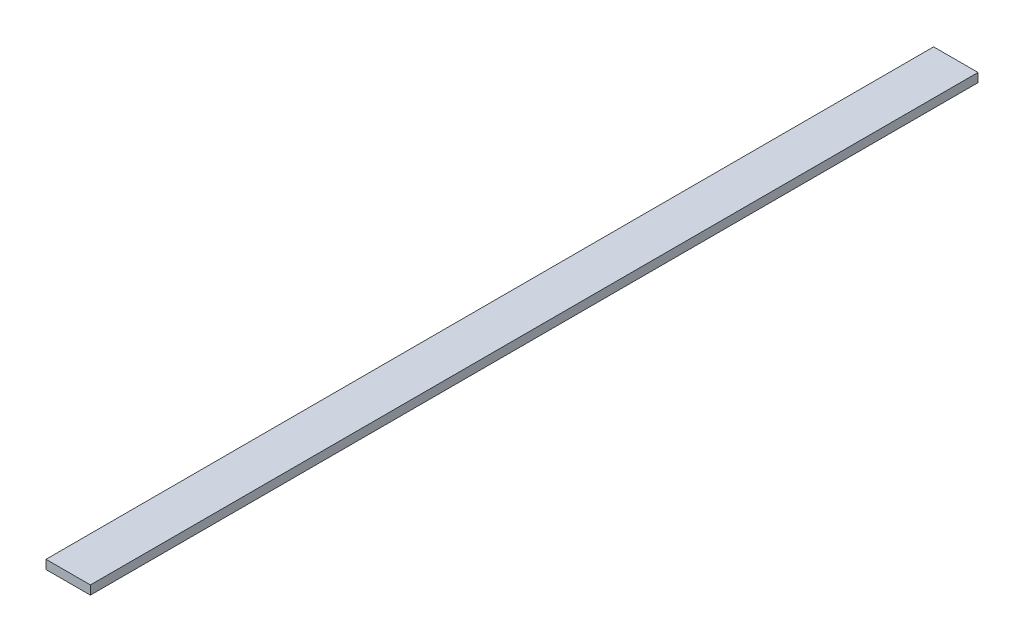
ISO-10303-21;
HEADER;
FILE_DESCRIPTION(('STEP AP214'),'2;1');
FILE_NAME('part.step','',(''),(''),'','','');
FILE_SCHEMA(('AUTOMOTIVE_DESIGN { 1 0 10303 214 1 1 1 1 }'));
ENDSEC;
DATA;
#1=APPLICATION_CONTEXT('core data for automotive mechanical design processes');
#2=APPLICATION_PROTOCOL_DEFINITION('international standard','automotive_design',2000,#1);
#3=PRODUCT_CONTEXT('',#1,'mechanical');
#4=PRODUCT('Part','Part','',(#3));
#5=PRODUCT_RELATED_PRODUCT_CATEGORY('part','',(#4));
#6=PRODUCT_DEFINITION_FORMATION('','',#4);
#7=PRODUCT_DEFINITION_CONTEXT('part definition',#1,'design');
#8=PRODUCT_DEFINITION('design','',#6,#7);
#9=PRODUCT_DEFINITION_SHAPE('','',#8);
#10=(LENGTH_UNIT() NAMED_UNIT(*) SI_UNIT(.MILLI.,.METRE.));
#11=(NAMED_UNIT(*) PLANE_ANGLE_UNIT() SI_UNIT($,.RADIAN.));
#12=(NAMED_UNIT(*) SI_UNIT($,.STERADIAN.) SOLID_ANGLE_UNIT());
#13=UNCERTAINTY_MEASURE_WITH_UNIT(LENGTH_MEASURE(1.E-05),#10,'distance_accuracy_value','');
#14=(GEOMETRIC_REPRESENTATION_CONTEXT(3) GLOBAL_UNCERTAINTY_ASSIGNED_CONTEXT((#13)) GLOBAL_UNIT_ASSIGNED_CONTEXT((#10,
#11,#12)) REPRESENTATION_CONTEXT('',''));
#15=CARTESIAN_POINT('',(0.,0.,0.));
#16=DIRECTION('',(0.,0.,1.));
#17=DIRECTION('',(1.,0.,0.));
#18=AXIS2_PLACEMENT_3D('',#15,#16,#17);
#19=CARTESIAN_POINT('',(12.5,0.,0.));
#20=DIRECTION('',(-1.,0.,0.));
#21=DIRECTION('',(0.,0.,1.));
#22=AXIS2_PLACEMENT_3D('',#19,#20,#21);
#23=PLANE('',#22);
#24=DIRECTION('',(0.,-1.,0.));
#25=VECTOR('',#24,1.);
#26=CARTESIAN_POINT('',(12.5,2.5,0.));
#27=LINE('',#26,#25);
#28=CARTESIAN_POINT('',(12.5,5.,0.));
#29=VERTEX_POINT('',#28);
#30=CARTESIAN_POINT('',(12.5,0.,0.));
#31=VERTEX_POINT('',#30);
#32=EDGE_CURVE('E51',#29,#31,#27,.T.);
#33=ORIENTED_EDGE('',*,*,#32,.F.);
#34=DIRECTION('',(0.,0.,-1.));
#35=VECTOR('',#34,1.);
#36=CARTESIAN_POINT('',(12.5,5.,250.));
#37=LINE('',#36,#35);
#38=CARTESIAN_POINT('',(12.5,5.,500.));
#39=VERTEX_POINT('',#38);
#40=EDGE_CURVE('E66',#39,#29,#37,.T.);
#41=ORIENTED_EDGE('',*,*,#40,.F.);
#42=DIRECTION('',(0.,-1.,0.));
#43=VECTOR('',#42,1.);
#44=CARTESIAN_POINT('',(12.5,2.5,500.));
#45=LINE('',#44,#43);
#46=CARTESIAN_POINT('',(12.5,0.,500.));
#47=VERTEX_POINT('',#46);
#48=EDGE_CURVE('E18',#39,#47,#45,.T.);
#49=ORIENTED_EDGE('',*,*,#48,.T.);
#50=DIRECTION('',(0.,0.,1.));
#51=VECTOR('',#50,1.);
#52=CARTESIAN_POINT('',(12.5,0.,250.));
#53=LINE('',#52,#51);
#54=EDGE_CURVE('E56',#31,#47,#53,.T.);
#55=ORIENTED_EDGE('',*,*,#54,.F.);
#56=EDGE_LOOP('',(#33,#41,#49,#55));
#57=FACE_BOUND('',#56,.T.);
#58=ADVANCED_FACE('F14',(#57),#23,.F.);
#59=CARTESIAN_POINT('',(12.5,0.,500.));
#60=DIRECTION('',(0.,0.,-1.));
#61=DIRECTION('',(-1.,0.,0.));
#62=AXIS2_PLACEMENT_3D('',#59,#60,#61);
#63=PLANE('',#62);
#64=DIRECTION('',(-1.,0.,0.));
#65=VECTOR('',#64,1.);
#66=CARTESIAN_POINT('',(0.,0.,500.));
#67=LINE('',#66,#65);
#68=CARTESIAN_POINT('',(-12.5,0.,500.));
#69=VERTEX_POINT('',#68);
#70=EDGE_CURVE('E61',#47,#69,#67,.T.);
#71=ORIENTED_EDGE('',*,*,#70,.F.);
#72=ORIENTED_EDGE('',*,*,#48,.F.);
#73=DIRECTION('',(1.,0.,0.));
#74=VECTOR('',#73,1.);
#75=CARTESIAN_POINT('',(0.,5.,500.));
#76=LINE('',#75,#74);
#77=CARTESIAN_POINT('',(-12.5,5.,500.));
#78=VERTEX_POINT('',#77);
#79=EDGE_CURVE('E79',#78,#39,#76,.T.);
#80=ORIENTED_EDGE('',*,*,#79,.F.);
#81=DIRECTION('',(0.,-1.,0.));
#82=VECTOR('',#81,1.);
#83=CARTESIAN_POINT('',(-12.5,2.5,500.));
#84=LINE('',#83,#82);
#85=EDGE_CURVE('E72',#78,#69,#84,.T.);
#86=ORIENTED_EDGE('',*,*,#85,.T.);
#87=EDGE_LOOP('',(#71,#72,#80,#86));
#88=FACE_BOUND('',#87,.T.);
#89=ADVANCED_FACE('F71',(#88),#63,.F.);
#90=CARTESIAN_POINT('',(-12.5,0.,500.));
#91=DIRECTION('',(0.,-1.,0.));
#92=DIRECTION('',(0.,0.,-1.));
#93=AXIS2_PLACEMENT_3D('',#90,#91,#92);
#94=PLANE('',#93);
#95=ORIENTED_EDGE('',*,*,#70,.T.);
#96=DIRECTION('',(0.,0.,-1.));
#97=VECTOR('',#96,1.);
#98=CARTESIAN_POINT('',(-12.5,0.,250.));
#99=LINE('',#98,#97);
#100=CARTESIAN_POINT('',(-12.5,0.,0.));
#101=VERTEX_POINT('',#100);
#102=EDGE_CURVE('E82',#69,#101,#99,.T.);
#103=ORIENTED_EDGE('',*,*,#102,.T.);
#104=DIRECTION('',(-1.,0.,0.));
#105=VECTOR('',#104,1.);
#106=CARTESIAN_POINT('',(0.,0.,0.));
#107=LINE('',#106,#105);
#108=EDGE_CURVE('E63',#31,#101,#107,.T.);
#109=ORIENTED_EDGE('',*,*,#108,.F.);
#110=ORIENTED_EDGE('',*,*,#54,.T.);
#111=EDGE_LOOP('',(#95,#103,#109,#110));
#112=FACE_BOUND('',#111,.T.);
#113=ADVANCED_FACE('F58',(#112),#94,.T.);
#114=CARTESIAN_POINT('',(12.5,0.,0.));
#115=DIRECTION('',(0.,0.,-1.));
#116=DIRECTION('',(-1.,0.,0.));
#117=AXIS2_PLACEMENT_3D('',#114,#115,#116);
#118=PLANE('',#117);
#119=ORIENTED_EDGE('',*,*,#32,.T.);
#120=ORIENTED_EDGE('',*,*,#108,.T.);
#121=DIRECTION('',(0.,1.,0.));
#122=VECTOR('',#121,1.);
#123=CARTESIAN_POINT('',(-12.5,2.5,0.));
#124=LINE('',#123,#122);
#125=CARTESIAN_POINT('',(-12.5,5.,0.));
#126=VERTEX_POINT('',#125);
#127=EDGE_CURVE('E24',#101,#126,#124,.T.);
#128=ORIENTED_EDGE('',*,*,#127,.T.);
#129=DIRECTION('',(-1.,0.,0.));
#130=VECTOR('',#129,1.);
#131=CARTESIAN_POINT('',(0.,5.,0.));
#132=LINE('',#131,#130);
#133=EDGE_CURVE('E32',#29,#126,#132,.T.);
#134=ORIENTED_EDGE('',*,*,#133,.F.);
#135=EDGE_LOOP('',(#119,#120,#128,#134));
#136=FACE_BOUND('',#135,.T.);
#137=ADVANCED_FACE('F86',(#136),#118,.T.);
#138=CARTESIAN_POINT('',(12.5,5.,0.));
#139=DIRECTION('',(0.,1.,0.));
#140=DIRECTION('',(-1.,0.,0.));
#141=AXIS2_PLACEMENT_3D('',#138,#139,#140);
#142=PLANE('',#141);
#143=DIRECTION('',(0.,0.,1.));
#144=VECTOR('',#143,1.);
#145=CARTESIAN_POINT('',(-12.5,5.,250.));
#146=LINE('',#145,#144);
#147=EDGE_CURVE('E9',#126,#78,#146,.T.);
#148=ORIENTED_EDGE('',*,*,#147,.T.);
#149=ORIENTED_EDGE('',*,*,#79,.T.);
#150=ORIENTED_EDGE('',*,*,#40,.T.);
#151=ORIENTED_EDGE('',*,*,#133,.T.);
#152=EDGE_LOOP('',(#148,#149,#150,#151));
#153=FACE_BOUND('',#152,.T.);
#154=ADVANCED_FACE('F88',(#153),#142,.T.);
#155=CARTESIAN_POINT('',(-12.5,0.,500.));
#156=DIRECTION('',(1.,0.,0.));
#157=DIRECTION('',(0.,0.,-1.));
#158=AXIS2_PLACEMENT_3D('',#155,#156,#157);
#159=PLANE('',#158);
#160=ORIENTED_EDGE('',*,*,#127,.F.);
#161=ORIENTED_EDGE('',*,*,#102,.F.);
#162=ORIENTED_EDGE('',*,*,#85,.F.);
#163=ORIENTED_EDGE('',*,*,#147,.F.);
#164=EDGE_LOOP('',(#160,#161,#162,#163));
#165=FACE_BOUND('',#164,.T.);
#166=ADVANCED_FACE('F16',(#165),#159,.F.);
#167=CLOSED_SHELL('',(#58,#89,#113,#137,#154,#166));
#168=MANIFOLD_SOLID_BREP('B1',#167);
#169=ADVANCED_BREP_SHAPE_REPRESENTATION('',(#18,#168),#14);
#170=SHAPE_DEFINITION_REPRESENTATION(#9,#169);
ENDSEC;
END-ISO-10303-21;
